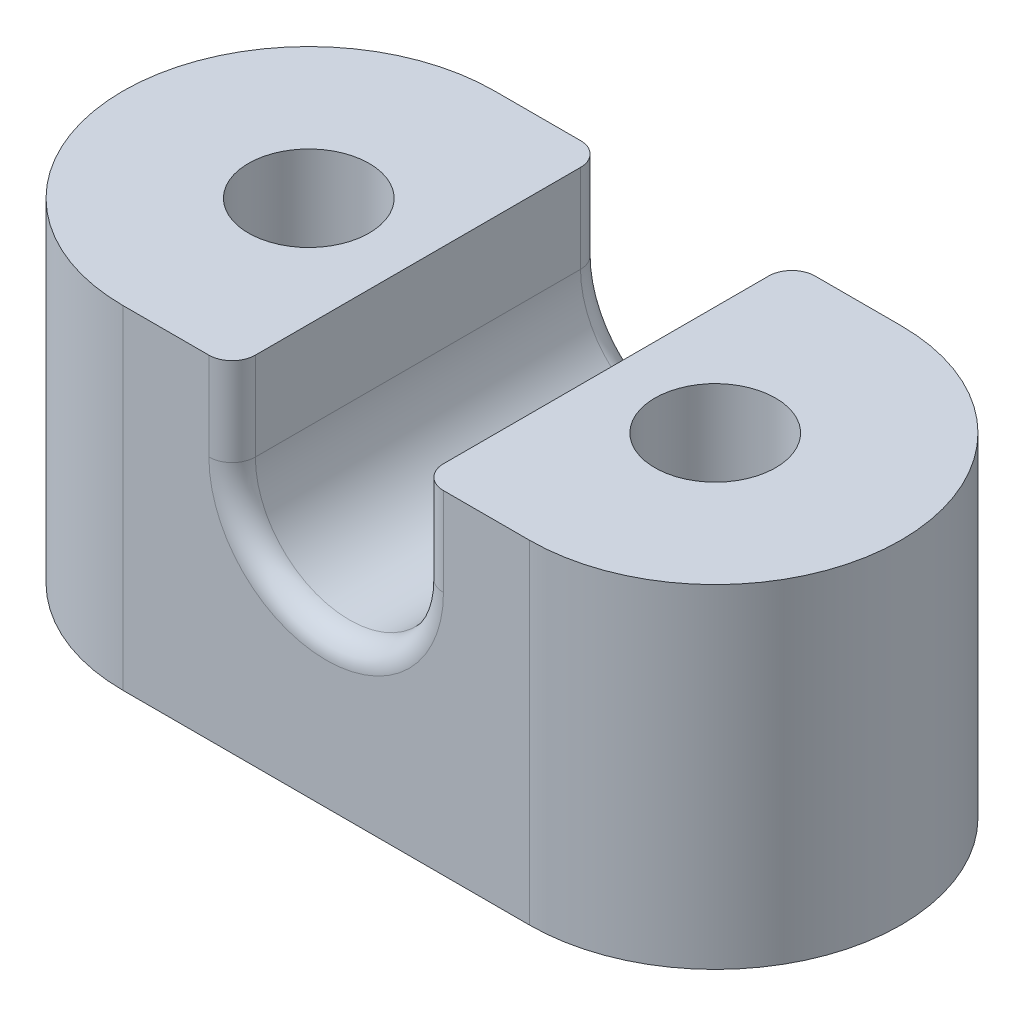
from build123d import *

# Parameters (mm, degrees)
BOSS_EXTRU_1_DEPTH      = 14.35
ESQUISSE3_R             = 2.6
ENL_V_MAT_EXTRU_1_DEPTH = 14.35
ESQUISSE4_R             = 4.25
ENL_V_MAT_EXTRU_2_DEPTH = 4
ENL_V_MAT_EXTRU_3_DEPTH = 73.525848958
CONG_1_R                = 1
CONG_2_R                = 1


with BuildPart() as part:
    # Esquisse2 → Boss.-Extru.1 (new body)
    with BuildSketch(Plane(origin=(0, 0, 0), x_dir=(1, 0, 0), z_dir=(0, 1, 0))):
        with BuildLine():
            Line((-61.268147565, 8), (-43.768147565, 8))
            ThreePointArc((-43.768147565, 8), (-35.768147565, 0), (-43.768147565, -8))
            Line((-43.768147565, -8), (-61.268147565, -8))
            ThreePointArc((-61.268147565, -8), (-69.268147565, 0), (-61.268147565, 8))
        make_face()
    extrude(amount=BOSS_EXTRU_1_DEPTH)

    # Esquisse3 → Enl_v. mat.-Extru.1 (cut)
    with BuildSketch(Plane.XZ):
        with Locations(Location((-61.268147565, 0, 0), (0, 0, 270))):
            Circle(ESQUISSE3_R)
        with Locations(Location((-43.768147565, 0, 0), (0, 0, 270))):
            Circle(ESQUISSE3_R)
    extrude(amount=-ENL_V_MAT_EXTRU_1_DEPTH, mode=Mode.SUBTRACT)

    # Esquisse4 → Enl_v. mat.-Extru.2 (cut)
    with BuildSketch(Plane.XZ):
        with Locations(Location((-43.768147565, 0, 0), (0, 0, 270))):
            Circle(ESQUISSE4_R)
        with Locations(Location((-61.268147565, 0, 0), (0, 0, 270))):
            Circle(ESQUISSE4_R)
    extrude(amount=-ENL_V_MAT_EXTRU_2_DEPTH, mode=Mode.SUBTRACT)

    # Esquisse5 → Enl_v. mat.-Extru.3 (cut, through all)
    with BuildSketch(Plane(origin=(0, 0, -8), x_dir=(-1, 0, 0), z_dir=(0, 0, -1))):
        with BuildLine():
            Line((48.468147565, 10.55), (48.468147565, 22.487117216))
            ThreePointArc((48.468147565, 22.487117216), (52.518147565, 26.537117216), (56.568147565, 22.487117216))
            Line((56.568147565, 22.487117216), (56.568147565, 10.55))
            ThreePointArc((56.568147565, 10.55), (52.518147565, 6.5), (48.468147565, 10.55))
        make_face()
    extrude(amount=-ENL_V_MAT_EXTRU_3_DEPTH, mode=Mode.SUBTRACT)

    # Cong_1
    cong_1_edges = [part.edges().sort_by_distance(p)[0] for p in [
        (-48.468147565, 12.45, -8),
        (-52.518147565, 6.5, -8),
        (-56.568147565, 12.45, -8),
    ]]
    fillet(cong_1_edges, radius=CONG_1_R)

    # Cong_2
    cong_2_edges = [part.edges().sort_by_distance(p)[0] for p in [
        (-52.518147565, 6.5, 8),
        (-48.468147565, 12.45, 8),
        (-56.568147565, 12.45, 8),
    ]]
    fillet(cong_2_edges, radius=CONG_2_R)


solid = part.part
